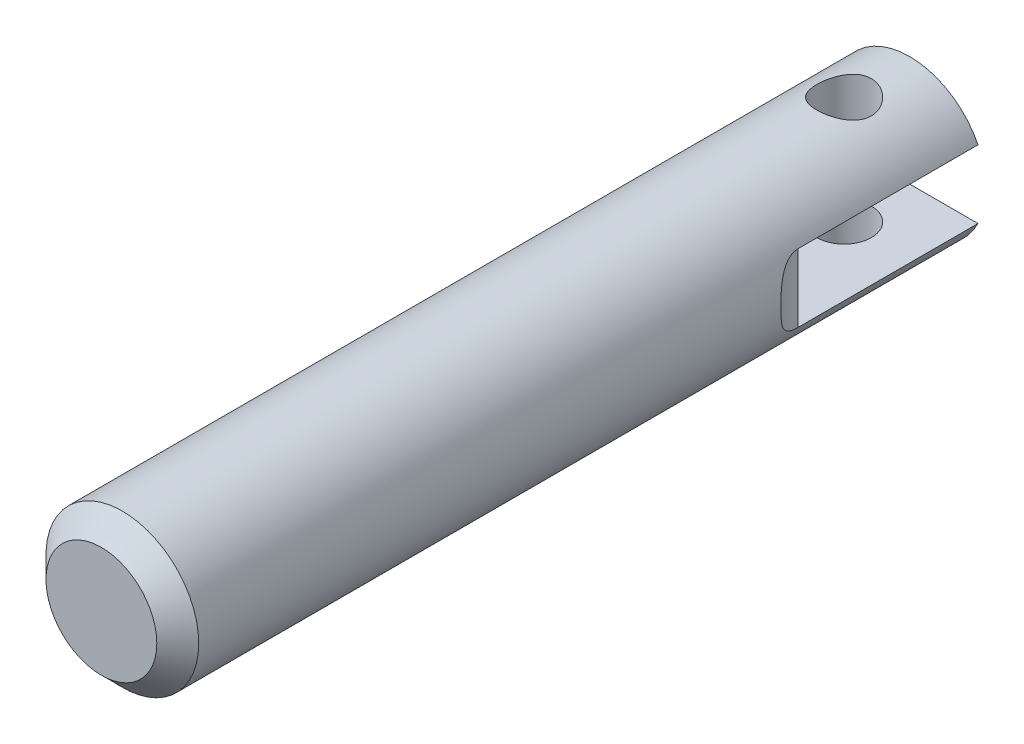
ISO-10303-21;
HEADER;
FILE_DESCRIPTION(('STEP AP214'),'2;1');
FILE_NAME('part.step','',(''),(''),'','','');
FILE_SCHEMA(('AUTOMOTIVE_DESIGN { 1 0 10303 214 1 1 1 1 }'));
ENDSEC;
DATA;
#1=APPLICATION_CONTEXT('core data for automotive mechanical design processes');
#2=APPLICATION_PROTOCOL_DEFINITION('international standard','automotive_design',2000,#1);
#3=PRODUCT_CONTEXT('',#1,'mechanical');
#4=PRODUCT('Part','Part','',(#3));
#5=PRODUCT_RELATED_PRODUCT_CATEGORY('part','',(#4));
#6=PRODUCT_DEFINITION_FORMATION('','',#4);
#7=PRODUCT_DEFINITION_CONTEXT('part definition',#1,'design');
#8=PRODUCT_DEFINITION('design','',#6,#7);
#9=PRODUCT_DEFINITION_SHAPE('','',#8);
#10=(LENGTH_UNIT() NAMED_UNIT(*) SI_UNIT(.MILLI.,.METRE.));
#11=(NAMED_UNIT(*) PLANE_ANGLE_UNIT() SI_UNIT($,.RADIAN.));
#12=(NAMED_UNIT(*) SI_UNIT($,.STERADIAN.) SOLID_ANGLE_UNIT());
#13=UNCERTAINTY_MEASURE_WITH_UNIT(LENGTH_MEASURE(1.E-05),#10,'distance_accuracy_value','');
#14=(GEOMETRIC_REPRESENTATION_CONTEXT(3) GLOBAL_UNCERTAINTY_ASSIGNED_CONTEXT((#13)) GLOBAL_UNIT_ASSIGNED_CONTEXT((#10,
#11,#12)) REPRESENTATION_CONTEXT('',''));
#15=CARTESIAN_POINT('',(0.,0.,0.));
#16=DIRECTION('',(0.,0.,1.));
#17=DIRECTION('',(1.,0.,0.));
#18=AXIS2_PLACEMENT_3D('',#15,#16,#17);
#19=CARTESIAN_POINT('',(0.,0.,-58.7375));
#20=DIRECTION('',(0.,0.,1.));
#21=DIRECTION('',(1.,0.,0.));
#22=AXIS2_PLACEMENT_3D('',#19,#20,#21);
#23=CYLINDRICAL_SURFACE('',#22,5.5499);
#24=CARTESIAN_POINT('',(0.,-5.5499,-51.9938));
#25=CARTESIAN_POINT('',(-0.107653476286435,-5.54990159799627,-51.9937977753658));
#26=CARTESIAN_POINT('',(-0.215291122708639,-5.54673970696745,-52.0026024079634));
#27=CARTESIAN_POINT('',(-0.427369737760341,-5.53444015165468,-52.0374614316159));
#28=CARTESIAN_POINT('',(-0.53181082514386,-5.52530270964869,-52.0635151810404));
#29=CARTESIAN_POINT('',(-0.73440812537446,-5.50203829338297,-52.1318472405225));
#30=CARTESIAN_POINT('',(-0.832575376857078,-5.48792038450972,-52.1740960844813));
#31=CARTESIAN_POINT('',(-1.02042663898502,-5.45611651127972,-52.273476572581));
#32=CARTESIAN_POINT('',(-1.11010861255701,-5.43842969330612,-52.3306117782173));
#33=CARTESIAN_POINT('',(-1.28194408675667,-5.40055797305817,-52.4604783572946));
#34=CARTESIAN_POINT('',(-1.36372163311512,-5.38030706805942,-52.5336877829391));
#35=CARTESIAN_POINT('',(-1.51413461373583,-5.33993096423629,-52.6926093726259));
#36=CARTESIAN_POINT('',(-1.5827665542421,-5.31980580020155,-52.7783248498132));
#37=CARTESIAN_POINT('',(-1.70722010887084,-5.28121081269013,-52.9633692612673));
#38=CARTESIAN_POINT('',(-1.76252965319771,-5.26282004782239,-53.0630607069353));
#39=CARTESIAN_POINT('',(-1.85543270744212,-5.23079269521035,-53.2710921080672));
#40=CARTESIAN_POINT('',(-1.89303254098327,-5.21715441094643,-53.3794289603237));
#41=CARTESIAN_POINT('',(-1.94799722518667,-5.19687703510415,-53.5973685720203));
#42=CARTESIAN_POINT('',(-1.96607415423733,-5.18999254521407,-53.7067681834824));
#43=CARTESIAN_POINT('',(-1.9837065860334,-5.18328042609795,-53.9272478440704));
#44=CARTESIAN_POINT('',(-1.98326884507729,-5.18345022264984,-54.0383272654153));
#45=CARTESIAN_POINT('',(-1.96443253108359,-5.19061434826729,-54.2527026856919));
#46=CARTESIAN_POINT('',(-1.94699465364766,-5.19724363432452,-54.3560974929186));
#47=CARTESIAN_POINT('',(-1.89623189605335,-5.21597727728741,-54.5583834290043));
#48=CARTESIAN_POINT('',(-1.86290484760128,-5.22808238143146,-54.6572739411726));
#49=CARTESIAN_POINT('',(-1.78073810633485,-5.25664108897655,-54.8498013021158));
#50=CARTESIAN_POINT('',(-1.73163368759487,-5.27316803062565,-54.9433138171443));
#51=CARTESIAN_POINT('',(-1.61949015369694,-5.30868100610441,-55.1210614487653));
#52=CARTESIAN_POINT('',(-1.55644656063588,-5.32766782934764,-55.2052935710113));
#53=CARTESIAN_POINT('',(-1.41372164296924,-5.36736271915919,-55.3674443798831));
#54=CARTESIAN_POINT('',(-1.33326496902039,-5.38810545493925,-55.4446736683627));
#55=CARTESIAN_POINT('',(-1.16029481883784,-5.42798069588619,-55.5847375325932));
#56=CARTESIAN_POINT('',(-1.06777982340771,-5.44711299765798,-55.6475702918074));
#57=CARTESIAN_POINT('',(-0.871693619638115,-5.48193106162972,-55.7577239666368));
#58=CARTESIAN_POINT('',(-0.767995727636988,-5.49756942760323,-55.8048354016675));
#59=CARTESIAN_POINT('',(-0.553451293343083,-5.52328978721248,-55.8807223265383));
#60=CARTESIAN_POINT('',(-0.442607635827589,-5.53337400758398,-55.9095051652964));
#61=CARTESIAN_POINT('',(-0.222735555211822,-5.54646843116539,-55.9466391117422));
#62=CARTESIAN_POINT('',(-0.113883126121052,-5.5498002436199,-55.9559199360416));
#63=CARTESIAN_POINT('',(0.103860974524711,-5.5499952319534,-55.9564673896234));
#64=CARTESIAN_POINT('',(0.212752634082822,-5.54685968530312,-55.9477375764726));
#65=CARTESIAN_POINT('',(0.423599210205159,-5.53468482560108,-55.9132320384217));
#66=CARTESIAN_POINT('',(0.525664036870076,-5.52585063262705,-55.8880481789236));
#67=CARTESIAN_POINT('',(0.724062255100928,-5.50337165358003,-55.8221111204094));
#68=CARTESIAN_POINT('',(0.82039490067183,-5.489726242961,-55.7813559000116));
#69=CARTESIAN_POINT('',(1.00763066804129,-5.45851059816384,-55.6841732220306));
#70=CARTESIAN_POINT('',(1.09830410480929,-5.44084054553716,-55.6273362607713));
#71=CARTESIAN_POINT('',(1.26911613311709,-5.40355346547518,-55.5000738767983));
#72=CARTESIAN_POINT('',(1.3492510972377,-5.38393577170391,-55.42964379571));
#73=CARTESIAN_POINT('',(1.50109735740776,-5.34364971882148,-55.2728383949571));
#74=CARTESIAN_POINT('',(1.57214657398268,-5.32298020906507,-55.1858205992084));
#75=CARTESIAN_POINT('',(1.69874319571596,-5.28394395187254,-55.0006708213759));
#76=CARTESIAN_POINT('',(1.75428984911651,-5.26557731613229,-54.9025383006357));
#77=CARTESIAN_POINT('',(1.84820044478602,-5.23335709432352,-54.6975154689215));
#78=CARTESIAN_POINT('',(1.88654644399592,-5.21950822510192,-54.5906161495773));
#79=CARTESIAN_POINT('',(1.94447571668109,-5.19820885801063,-54.3712548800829));
#80=CARTESIAN_POINT('',(1.9640691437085,-5.19075489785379,-54.2587959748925));
#81=CARTESIAN_POINT('',(1.98307797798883,-5.18352052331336,-54.0386047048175));
#82=CARTESIAN_POINT('',(1.98360873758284,-5.1833159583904,-53.9309816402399));
#83=CARTESIAN_POINT('',(1.96728484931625,-5.18953321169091,-53.7172674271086));
#84=CARTESIAN_POINT('',(1.95043155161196,-5.19595451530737,-53.6111761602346));
#85=CARTESIAN_POINT('',(1.90065338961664,-5.21436277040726,-53.406211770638));
#86=CARTESIAN_POINT('',(1.86814141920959,-5.22620636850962,-53.3072244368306));
#87=CARTESIAN_POINT('',(1.78831843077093,-5.25405419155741,-53.1160420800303));
#88=CARTESIAN_POINT('',(1.74100385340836,-5.27005941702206,-53.0238486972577));
#89=CARTESIAN_POINT('',(1.63023820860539,-5.30539772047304,-52.8439971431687));
#90=CARTESIAN_POINT('',(1.56611356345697,-5.32485489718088,-52.7567784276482));
#91=CARTESIAN_POINT('',(1.42463268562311,-5.3644386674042,-52.5939811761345));
#92=CARTESIAN_POINT('',(1.3472724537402,-5.38456546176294,-52.5184061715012));
#93=CARTESIAN_POINT('',(1.1771480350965,-5.42436029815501,-52.3774261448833));
#94=CARTESIAN_POINT('',(1.08382958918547,-5.44396198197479,-52.312668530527));
#95=CARTESIAN_POINT('',(0.886959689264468,-5.47947839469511,-52.1998027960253));
#96=CARTESIAN_POINT('',(0.783409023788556,-5.49539340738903,-52.1516933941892));
#97=CARTESIAN_POINT('',(0.568515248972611,-5.52176869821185,-52.0736704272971));
#98=CARTESIAN_POINT('',(0.457143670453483,-5.53220773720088,-52.043827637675));
#99=CARTESIAN_POINT('',(0.230507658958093,-5.54627120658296,-52.0038974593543));
#100=CARTESIAN_POINT('',(0.115244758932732,-5.54989828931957,-51.9938023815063));
#101=CARTESIAN_POINT('',(0.,-5.5499,-51.9938));
#102=B_SPLINE_CURVE_WITH_KNOTS('',3,(#24,#25,#26,#27,#28,#29,#30,#31,#32,#33,#34,#35,#36,#37,
#38,#39,#40,#41,#42,#43,#44,#45,#46,#47,#48,#49,#50,#51,#52,#53,#54,#55,#56,#57,#58,#59,#60,#61,
#62,#63,#64,#65,#66,#67,#68,#69,#70,#71,#72,#73,#74,#75,#76,#77,#78,#79,#80,#81,#82,#83,#84,#85,
#86,#87,#88,#89,#90,#91,#92,#93,#94,#95,#96,#97,#98,#99,#100,#101),.UNSPECIFIED.,.T.,.F.,(4,2,2,
2,2,2,2,2,2,2,2,2,2,2,2,2,2,2,2,2,2,2,2,2,2,2,2,2,2,2,2,2,2,2,2,2,2,2,4),(0.,0.32253577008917,
0.645059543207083,0.966999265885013,1.28901608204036,1.62236399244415,1.95580037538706,
2.30051976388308,2.64511596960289,2.9766682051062,3.30809945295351,3.62182603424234,
3.93559544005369,4.25493155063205,4.57437039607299,4.91311834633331,5.25190901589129,
5.59504875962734,5.93805083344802,6.26429118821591,6.59046710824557,6.90551213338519,
7.22059806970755,7.544568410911,7.86864997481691,8.20972589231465,8.55081834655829,
8.89226579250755,9.23352825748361,9.55478885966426,9.87602451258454,10.1892184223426,
10.5024876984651,10.8310117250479,11.1596351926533,11.5037509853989,11.847840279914,
12.1932544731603,12.5385341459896),.UNSPECIFIED.);
#103=CARTESIAN_POINT('',(0.,-5.5499,-51.9938));
#104=VERTEX_POINT('',#103);
#105=EDGE_CURVE('E84',#104,#104,#102,.T.);
#106=ORIENTED_EDGE('',*,*,#105,.F.);
#107=EDGE_LOOP('',(#106));
#108=FACE_BOUND('',#107,.T.);
#109=CARTESIAN_POINT('',(0.,5.5499,-51.9938));
#110=CARTESIAN_POINT('',(0.107653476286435,5.54990159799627,-51.9937977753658));
#111=CARTESIAN_POINT('',(0.215291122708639,5.54673970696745,-52.0026024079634));
#112=CARTESIAN_POINT('',(0.427369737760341,5.53444015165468,-52.0374614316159));
#113=CARTESIAN_POINT('',(0.53181082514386,5.52530270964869,-52.0635151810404));
#114=CARTESIAN_POINT('',(0.73440812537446,5.50203829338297,-52.1318472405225));
#115=CARTESIAN_POINT('',(0.832575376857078,5.48792038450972,-52.1740960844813));
#116=CARTESIAN_POINT('',(1.02042663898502,5.45611651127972,-52.273476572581));
#117=CARTESIAN_POINT('',(1.11010861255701,5.43842969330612,-52.3306117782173));
#118=CARTESIAN_POINT('',(1.28194408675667,5.40055797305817,-52.4604783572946));
#119=CARTESIAN_POINT('',(1.36372163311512,5.38030706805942,-52.5336877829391));
#120=CARTESIAN_POINT('',(1.51413461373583,5.33993096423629,-52.6926093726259));
#121=CARTESIAN_POINT('',(1.5827665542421,5.31980580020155,-52.7783248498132));
#122=CARTESIAN_POINT('',(1.70722010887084,5.28121081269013,-52.9633692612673));
#123=CARTESIAN_POINT('',(1.76252965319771,5.26282004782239,-53.0630607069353));
#124=CARTESIAN_POINT('',(1.85543270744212,5.23079269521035,-53.2710921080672));
#125=CARTESIAN_POINT('',(1.89303254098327,5.21715441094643,-53.3794289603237));
#126=CARTESIAN_POINT('',(1.94799722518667,5.19687703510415,-53.5973685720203));
#127=CARTESIAN_POINT('',(1.96607415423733,5.18999254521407,-53.7067681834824));
#128=CARTESIAN_POINT('',(1.9837065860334,5.18328042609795,-53.9272478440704));
#129=CARTESIAN_POINT('',(1.98326884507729,5.18345022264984,-54.0383272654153));
#130=CARTESIAN_POINT('',(1.96443253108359,5.19061434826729,-54.2527026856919));
#131=CARTESIAN_POINT('',(1.94699465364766,5.19724363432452,-54.3560974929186));
#132=CARTESIAN_POINT('',(1.89623189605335,5.21597727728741,-54.5583834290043));
#133=CARTESIAN_POINT('',(1.86290484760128,5.22808238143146,-54.6572739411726));
#134=CARTESIAN_POINT('',(1.78073810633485,5.25664108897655,-54.8498013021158));
#135=CARTESIAN_POINT('',(1.73163368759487,5.27316803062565,-54.9433138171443));
#136=CARTESIAN_POINT('',(1.61949015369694,5.30868100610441,-55.1210614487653));
#137=CARTESIAN_POINT('',(1.55644656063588,5.32766782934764,-55.2052935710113));
#138=CARTESIAN_POINT('',(1.41372164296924,5.36736271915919,-55.3674443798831));
#139=CARTESIAN_POINT('',(1.33326496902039,5.38810545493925,-55.4446736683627));
#140=CARTESIAN_POINT('',(1.16029481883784,5.42798069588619,-55.5847375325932));
#141=CARTESIAN_POINT('',(1.06777982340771,5.44711299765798,-55.6475702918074));
#142=CARTESIAN_POINT('',(0.871693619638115,5.48193106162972,-55.7577239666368));
#143=CARTESIAN_POINT('',(0.767995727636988,5.49756942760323,-55.8048354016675));
#144=CARTESIAN_POINT('',(0.553451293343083,5.52328978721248,-55.8807223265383));
#145=CARTESIAN_POINT('',(0.442607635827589,5.53337400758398,-55.9095051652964));
#146=CARTESIAN_POINT('',(0.222735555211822,5.54646843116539,-55.9466391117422));
#147=CARTESIAN_POINT('',(0.113883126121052,5.5498002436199,-55.9559199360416));
#148=CARTESIAN_POINT('',(-0.103860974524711,5.5499952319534,-55.9564673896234));
#149=CARTESIAN_POINT('',(-0.212752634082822,5.54685968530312,-55.9477375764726));
#150=CARTESIAN_POINT('',(-0.423599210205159,5.53468482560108,-55.9132320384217));
#151=CARTESIAN_POINT('',(-0.525664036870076,5.52585063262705,-55.8880481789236));
#152=CARTESIAN_POINT('',(-0.724062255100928,5.50337165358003,-55.8221111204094));
#153=CARTESIAN_POINT('',(-0.82039490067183,5.489726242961,-55.7813559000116));
#154=CARTESIAN_POINT('',(-1.00763066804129,5.45851059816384,-55.6841732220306));
#155=CARTESIAN_POINT('',(-1.09830410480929,5.44084054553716,-55.6273362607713));
#156=CARTESIAN_POINT('',(-1.26911613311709,5.40355346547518,-55.5000738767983));
#157=CARTESIAN_POINT('',(-1.3492510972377,5.38393577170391,-55.42964379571));
#158=CARTESIAN_POINT('',(-1.50109735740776,5.34364971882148,-55.2728383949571));
#159=CARTESIAN_POINT('',(-1.57214657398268,5.32298020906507,-55.1858205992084));
#160=CARTESIAN_POINT('',(-1.69874319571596,5.28394395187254,-55.0006708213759));
#161=CARTESIAN_POINT('',(-1.75428984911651,5.26557731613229,-54.9025383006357));
#162=CARTESIAN_POINT('',(-1.84820044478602,5.23335709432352,-54.6975154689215));
#163=CARTESIAN_POINT('',(-1.88654644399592,5.21950822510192,-54.5906161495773));
#164=CARTESIAN_POINT('',(-1.94447571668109,5.19820885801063,-54.3712548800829));
#165=CARTESIAN_POINT('',(-1.9640691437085,5.19075489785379,-54.2587959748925));
#166=CARTESIAN_POINT('',(-1.98307797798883,5.18352052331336,-54.0386047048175));
#167=CARTESIAN_POINT('',(-1.98360873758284,5.1833159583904,-53.9309816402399));
#168=CARTESIAN_POINT('',(-1.96728484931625,5.18953321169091,-53.7172674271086));
#169=CARTESIAN_POINT('',(-1.95043155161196,5.19595451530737,-53.6111761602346));
#170=CARTESIAN_POINT('',(-1.90065338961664,5.21436277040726,-53.406211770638));
#171=CARTESIAN_POINT('',(-1.86814141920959,5.22620636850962,-53.3072244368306));
#172=CARTESIAN_POINT('',(-1.78831843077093,5.25405419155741,-53.1160420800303));
#173=CARTESIAN_POINT('',(-1.74100385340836,5.27005941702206,-53.0238486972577));
#174=CARTESIAN_POINT('',(-1.63023820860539,5.30539772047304,-52.8439971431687));
#175=CARTESIAN_POINT('',(-1.56611356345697,5.32485489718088,-52.7567784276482));
#176=CARTESIAN_POINT('',(-1.42463268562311,5.3644386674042,-52.5939811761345));
#177=CARTESIAN_POINT('',(-1.3472724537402,5.38456546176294,-52.5184061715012));
#178=CARTESIAN_POINT('',(-1.1771480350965,5.42436029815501,-52.3774261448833));
#179=CARTESIAN_POINT('',(-1.08382958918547,5.44396198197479,-52.312668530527));
#180=CARTESIAN_POINT('',(-0.886959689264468,5.47947839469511,-52.1998027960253));
#181=CARTESIAN_POINT('',(-0.783409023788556,5.49539340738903,-52.1516933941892));
#182=CARTESIAN_POINT('',(-0.568515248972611,5.52176869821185,-52.0736704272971));
#183=CARTESIAN_POINT('',(-0.457143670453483,5.53220773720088,-52.043827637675));
#184=CARTESIAN_POINT('',(-0.230507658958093,5.54627120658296,-52.0038974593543));
#185=CARTESIAN_POINT('',(-0.115244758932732,5.54989828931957,-51.9938023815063));
#186=CARTESIAN_POINT('',(0.,5.5499,-51.9938));
#187=B_SPLINE_CURVE_WITH_KNOTS('',3,(#109,#110,#111,#112,#113,#114,#115,#116,#117,#118,#119,
#120,#121,#122,#123,#124,#125,#126,#127,#128,#129,#130,#131,#132,#133,#134,#135,#136,#137,#138,
#139,#140,#141,#142,#143,#144,#145,#146,#147,#148,#149,#150,#151,#152,#153,#154,#155,#156,#157,
#158,#159,#160,#161,#162,#163,#164,#165,#166,#167,#168,#169,#170,#171,#172,#173,#174,#175,#176,
#177,#178,#179,#180,#181,#182,#183,#184,#185,#186),.UNSPECIFIED.,.T.,.F.,(4,2,2,2,2,2,2,2,2,2,2,
2,2,2,2,2,2,2,2,2,2,2,2,2,2,2,2,2,2,2,2,2,2,2,2,2,2,2,4),(0.,0.32253577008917,0.645059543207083,
0.966999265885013,1.28901608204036,1.62236399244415,1.95580037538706,2.30051976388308,
2.64511596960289,2.9766682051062,3.30809945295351,3.62182603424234,3.93559544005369,
4.25493155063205,4.57437039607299,4.91311834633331,5.25190901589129,5.59504875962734,
5.93805083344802,6.26429118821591,6.59046710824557,6.90551213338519,7.22059806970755,
7.544568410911,7.86864997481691,8.20972589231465,8.55081834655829,8.89226579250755,
9.23352825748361,9.55478885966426,9.87602451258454,10.1892184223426,10.5024876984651,
10.8310117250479,11.1596351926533,11.5037509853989,11.847840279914,12.1932544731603,
12.5385341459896),.UNSPECIFIED.);
#188=CARTESIAN_POINT('',(0.,5.5499,-51.9938));
#189=VERTEX_POINT('',#188);
#190=EDGE_CURVE('E157',#189,#189,#187,.T.);
#191=ORIENTED_EDGE('',*,*,#190,.F.);
#192=EDGE_LOOP('',(#191));
#193=FACE_BOUND('',#192,.T.);
#194=CARTESIAN_POINT('',(0.,0.,-1.52400000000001));
#195=DIRECTION('',(0.,0.,1.));
#196=DIRECTION('',(1.,0.,0.));
#197=AXIS2_PLACEMENT_3D('',#194,#195,#196);
#198=CIRCLE('',#197,5.5499);
#199=CARTESIAN_POINT('',(5.5499,0.,-1.52400000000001));
#200=VERTEX_POINT('',#199);
#201=EDGE_CURVE('E123',#200,#200,#198,.F.);
#202=ORIENTED_EDGE('',*,*,#201,.T.);
#203=EDGE_LOOP('',(#202));
#204=FACE_BOUND('',#203,.T.);
#205=DIRECTION('',(0.,0.,1.));
#206=VECTOR('',#205,1.);
#207=CARTESIAN_POINT('',(-4.96672304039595,2.4765,-58.7375));
#208=LINE('',#207,#206);
#209=CARTESIAN_POINT('',(-4.96672304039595,2.4765,-58.7375));
#210=VERTEX_POINT('',#209);
#211=CARTESIAN_POINT('',(-4.96672304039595,2.4765,-45.6565));
#212=VERTEX_POINT('',#211);
#213=EDGE_CURVE('E51',#210,#212,#208,.T.);
#214=ORIENTED_EDGE('',*,*,#213,.T.);
#215=CARTESIAN_POINT('',(-5.5499,0.,-47.4903697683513));
#216=CARTESIAN_POINT('',(-5.54989925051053,0.0810977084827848,-47.4903702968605));
#217=CARTESIAN_POINT('',(-5.548119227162,0.162213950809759,-47.4878611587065));
#218=CARTESIAN_POINT('',(-5.5410275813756,0.323978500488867,-47.4777755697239));
#219=CARTESIAN_POINT('',(-5.53571549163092,0.404626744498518,-47.4701984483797));
#220=CARTESIAN_POINT('',(-5.5216307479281,0.565246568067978,-47.449792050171));
#221=CARTESIAN_POINT('',(-5.51284607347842,0.645214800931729,-47.4369445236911));
#222=CARTESIAN_POINT('',(-5.49199361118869,0.803599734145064,-47.4057600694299));
#223=CARTESIAN_POINT('',(-5.47992758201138,0.882017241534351,-47.3874260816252));
#224=CARTESIAN_POINT('',(-5.45266509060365,1.03735188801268,-47.3447650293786));
#225=CARTESIAN_POINT('',(-5.43744442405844,1.11425206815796,-47.3203913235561));
#226=CARTESIAN_POINT('',(-5.40431869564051,1.26518746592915,-47.2653119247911));
#227=CARTESIAN_POINT('',(-5.38641305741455,1.33922206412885,-47.2346048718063));
#228=CARTESIAN_POINT('',(-5.34852203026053,1.48331735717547,-47.1665217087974));
#229=CARTESIAN_POINT('',(-5.32854359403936,1.55339019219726,-47.1291676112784));
#230=CARTESIAN_POINT('',(-5.2872019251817,1.68875525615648,-47.0473390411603));
#231=CARTESIAN_POINT('',(-5.26583969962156,1.75405088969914,-47.0028697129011));
#232=CARTESIAN_POINT('',(-5.21757201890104,1.89339622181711,-46.8951360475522));
#233=CARTESIAN_POINT('',(-5.19054029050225,1.96591350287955,-46.8299091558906));
#234=CARTESIAN_POINT('',(-5.1379956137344,2.09941626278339,-46.6879819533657));
#235=CARTESIAN_POINT('',(-5.11248199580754,2.1604068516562,-46.6112867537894));
#236=CARTESIAN_POINT('',(-5.06537701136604,2.26867280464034,-46.4465074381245));
#237=CARTESIAN_POINT('',(-5.04382291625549,2.3158201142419,-46.3583272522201));
#238=CARTESIAN_POINT('',(-5.00767787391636,2.39298990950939,-46.1734253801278));
#239=CARTESIAN_POINT('',(-4.99308022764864,2.42302887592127,-46.0767120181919));
#240=CARTESIAN_POINT('',(-4.97435221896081,2.46121747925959,-45.8925391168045));
#241=CARTESIAN_POINT('',(-4.96903016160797,2.47186903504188,-45.8057147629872));
#242=CARTESIAN_POINT('',(-4.96562843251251,2.47869847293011,-45.6313717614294));
#243=CARTESIAN_POINT('',(-4.96754514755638,2.47488357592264,-45.5438534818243));
#244=CARTESIAN_POINT('',(-4.9779417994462,2.4538944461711,-45.3782225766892));
#245=CARTESIAN_POINT('',(-4.98586918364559,2.43784434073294,-45.2999282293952));
#246=CARTESIAN_POINT('',(-5.00687394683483,2.39440614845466,-45.1473025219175));
#247=CARTESIAN_POINT('',(-5.01995130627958,2.36701810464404,-45.0729711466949));
#248=CARTESIAN_POINT('',(-5.05066737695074,2.30076513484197,-44.9272900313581));
#249=CARTESIAN_POINT('',(-5.06845391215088,2.2615210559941,-44.8561452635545));
#250=CARTESIAN_POINT('',(-5.10686211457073,2.17339763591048,-44.7209839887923));
#251=CARTESIAN_POINT('',(-5.12748471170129,2.12451513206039,-44.6569698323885));
#252=CARTESIAN_POINT('',(-5.17292348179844,2.01157050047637,-44.528630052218));
#253=CARTESIAN_POINT('',(-5.19793284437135,1.94635456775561,-44.4653922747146));
#254=CARTESIAN_POINT('',(-5.24781749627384,1.80755804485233,-44.3488463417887));
#255=CARTESIAN_POINT('',(-5.27269265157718,1.73397029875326,-44.2955467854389));
#256=CARTESIAN_POINT('',(-5.33327791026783,1.5402678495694,-44.1732316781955));
#257=CARTESIAN_POINT('',(-5.36789747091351,1.41585420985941,-44.1104519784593));
#258=CARTESIAN_POINT('',(-5.42956670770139,1.15714553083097,-44.0046576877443));
#259=CARTESIAN_POINT('',(-5.45660346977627,1.02283412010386,-43.9616767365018));
#260=CARTESIAN_POINT('',(-5.50136495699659,0.745920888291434,-43.8927414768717));
#261=CARTESIAN_POINT('',(-5.51891784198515,0.603214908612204,-43.867099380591));
#262=CARTESIAN_POINT('',(-5.5428502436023,0.314852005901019,-43.8325117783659));
#263=CARTESIAN_POINT('',(-5.54922756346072,0.169194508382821,-43.8235695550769));
#264=CARTESIAN_POINT('',(-5.55022339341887,-0.0638077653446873,-43.8221797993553));
#265=CARTESIAN_POINT('',(-5.54852684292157,-0.151156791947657,-43.8245626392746));
#266=CARTESIAN_POINT('',(-5.54104195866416,-0.325313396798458,-43.8352006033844));
#267=CARTESIAN_POINT('',(-5.53525473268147,-0.412121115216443,-43.8434541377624));
#268=CARTESIAN_POINT('',(-5.51970247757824,-0.584614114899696,-43.8660192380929));
#269=CARTESIAN_POINT('',(-5.50993646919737,-0.670299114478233,-43.880332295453));
#270=CARTESIAN_POINT('',(-5.48666013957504,-0.839807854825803,-43.915321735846));
#271=CARTESIAN_POINT('',(-5.47315090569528,-0.923632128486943,-43.935996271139));
#272=CARTESIAN_POINT('',(-5.43416410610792,-1.13505983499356,-43.9976547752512));
#273=CARTESIAN_POINT('',(-5.40622363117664,-1.26084707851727,-44.0435259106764));
#274=CARTESIAN_POINT('',(-5.34414720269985,-1.50231906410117,-44.1537753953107));
#275=CARTESIAN_POINT('',(-5.31002163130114,-1.61802026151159,-44.2181228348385));
#276=CARTESIAN_POINT('',(-5.24706326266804,-1.81041123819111,-44.3504937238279));
#277=CARTESIAN_POINT('',(-5.21875292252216,-1.89003958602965,-44.4144788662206));
#278=CARTESIAN_POINT('',(-5.16292620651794,-2.03759310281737,-44.5550948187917));
#279=CARTESIAN_POINT('',(-5.13540895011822,-2.1055317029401,-44.6317109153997));
#280=CARTESIAN_POINT('',(-5.08821779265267,-2.21686581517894,-44.7835831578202));
#281=CARTESIAN_POINT('',(-5.06799509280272,-2.26245351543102,-44.8570563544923));
#282=CARTESIAN_POINT('',(-5.03196429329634,-2.34149918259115,-45.0113010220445));
#283=CARTESIAN_POINT('',(-5.01615462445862,-2.37496146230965,-45.0920698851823));
#284=CARTESIAN_POINT('',(-4.99051828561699,-2.42837669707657,-45.2593591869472));
#285=CARTESIAN_POINT('',(-4.9807219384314,-2.44826124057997,-45.3459063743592));
#286=CARTESIAN_POINT('',(-4.9683691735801,-2.47323711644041,-45.5216195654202));
#287=CARTESIAN_POINT('',(-4.96581031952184,-2.47833342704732,-45.6107846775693));
#288=CARTESIAN_POINT('',(-4.96811476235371,-2.47370601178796,-45.7805967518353));
#289=CARTESIAN_POINT('',(-4.97233379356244,-2.4652688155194,-45.8612913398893));
#290=CARTESIAN_POINT('',(-4.98658637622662,-2.43630941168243,-46.0199269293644));
#291=CARTESIAN_POINT('',(-4.99661926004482,-2.41578859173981,-46.0978682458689));
#292=CARTESIAN_POINT('',(-5.0215872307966,-2.3634476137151,-46.2491883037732));
#293=CARTESIAN_POINT('',(-5.03653329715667,-2.33160213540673,-46.3225563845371));
#294=CARTESIAN_POINT('',(-5.07003769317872,-2.25781861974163,-46.4630990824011));
#295=CARTESIAN_POINT('',(-5.08859698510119,-2.21587789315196,-46.5302720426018));
#296=CARTESIAN_POINT('',(-5.12997813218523,-2.11843951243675,-46.6641873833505));
#297=CARTESIAN_POINT('',(-5.15304265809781,-2.06198433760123,-46.7301547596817));
#298=CARTESIAN_POINT('',(-5.20007695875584,-1.94032427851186,-46.8530276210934));
#299=CARTESIAN_POINT('',(-5.22404724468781,-1.87511439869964,-46.9099278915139));
#300=CARTESIAN_POINT('',(-5.28288037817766,-1.70416449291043,-47.0403318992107));
#301=CARTESIAN_POINT('',(-5.31736222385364,-1.59415328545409,-47.1084244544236));
#302=CARTESIAN_POINT('',(-5.38120813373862,-1.36323621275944,-47.2264397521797));
#303=CARTESIAN_POINT('',(-5.41055777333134,-1.24230104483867,-47.2763116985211));
#304=CARTESIAN_POINT('',(-5.45228553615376,-1.03943978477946,-47.3442432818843));
#305=CARTESIAN_POINT('',(-5.46693129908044,-0.959570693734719,-47.367252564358));
#306=CARTESIAN_POINT('',(-5.49287689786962,-0.797746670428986,-47.4071603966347));
#307=CARTESIAN_POINT('',(-5.50417543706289,-0.715790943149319,-47.4240565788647));
#308=CARTESIAN_POINT('',(-5.52313766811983,-0.550670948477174,-47.4520272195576));
#309=CARTESIAN_POINT('',(-5.53080890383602,-0.467509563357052,-47.4631137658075));
#310=CARTESIAN_POINT('',(-5.54239519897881,-0.300416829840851,-47.4797455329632));
#311=CARTESIAN_POINT('',(-5.54631249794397,-0.21648597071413,-47.4852940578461));
#312=CARTESIAN_POINT('',(-5.5493732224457,-0.0883161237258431,-47.4896250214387));
#313=CARTESIAN_POINT('',(-5.54990040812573,-0.0441608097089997,-47.4903694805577));
#314=CARTESIAN_POINT('',(-5.5499,0.,-47.4903697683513));
#315=B_SPLINE_CURVE_WITH_KNOTS('',3,(#215,#216,#217,#218,#219,#220,#221,#222,#223,#224,#225,
#226,#227,#228,#229,#230,#231,#232,#233,#234,#235,#236,#237,#238,#239,#240,#241,#242,#243,#244,
#245,#246,#247,#248,#249,#250,#251,#252,#253,#254,#255,#256,#257,#258,#259,#260,#261,#262,#263,
#264,#265,#266,#267,#268,#269,#270,#271,#272,#273,#274,#275,#276,#277,#278,#279,#280,#281,#282,
#283,#284,#285,#286,#287,#288,#289,#290,#291,#292,#293,#294,#295,#296,#297,#298,#299,#300,#301,
#302,#303,#304,#305,#306,#307,#308,#309,#310,#311,#312,#313,#314),.UNSPECIFIED.,.T.,.F.,(4,2,2,
2,2,2,2,2,2,2,2,2,2,2,2,2,2,2,2,2,2,2,2,2,2,2,2,2,2,2,2,2,2,2,2,2,2,2,2,2,2,2,2,2,2,2,2,2,2,4),
(0.,0.243266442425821,0.486565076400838,0.730713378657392,0.974731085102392,1.22069537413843,
1.46671253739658,1.71192965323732,1.95697027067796,2.2594126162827,2.56172056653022,
2.86674270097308,3.17147050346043,3.43294201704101,3.69428303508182,3.93413783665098,
4.17399172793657,4.42251772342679,4.67112540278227,4.95275213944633,5.23462143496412,
5.66303414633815,6.0921721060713,6.52884505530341,6.96560383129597,7.22754184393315,
7.48940894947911,7.75134054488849,8.01319613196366,8.42192685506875,8.82997774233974,
9.14679882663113,9.46325342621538,9.72854298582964,9.99373809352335,10.2602597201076,
10.5266916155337,10.7692594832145,11.0117995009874,11.2548852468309,11.4980358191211,
11.7665361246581,12.0351902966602,12.4346935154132,12.8353021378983,13.0882082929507,
13.3412122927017,13.5936877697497,13.8460125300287,13.9784804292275),.UNSPECIFIED.);
#316=CARTESIAN_POINT('',(-4.96672304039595,-2.4765,-45.6565));
#317=VERTEX_POINT('',#316);
#318=EDGE_CURVE('E80',#212,#317,#315,.T.);
#319=ORIENTED_EDGE('',*,*,#318,.T.);
#320=DIRECTION('',(0.,0.,1.));
#321=VECTOR('',#320,1.);
#322=CARTESIAN_POINT('',(-4.96672304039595,-2.4765,-58.7375));
#323=LINE('',#322,#321);
#324=CARTESIAN_POINT('',(-4.96672304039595,-2.4765,-58.7375));
#325=VERTEX_POINT('',#324);
#326=EDGE_CURVE('E90',#325,#317,#323,.T.);
#327=ORIENTED_EDGE('',*,*,#326,.F.);
#328=CARTESIAN_POINT('',(0.,0.,-58.7375));
#329=DIRECTION('',(0.,0.,1.));
#330=DIRECTION('',(1.,0.,0.));
#331=AXIS2_PLACEMENT_3D('',#328,#329,#330);
#332=CIRCLE('',#331,5.5499);
#333=CARTESIAN_POINT('',(4.96672304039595,-2.4765,-58.7375));
#334=VERTEX_POINT('',#333);
#335=EDGE_CURVE('E117',#325,#334,#332,.T.);
#336=ORIENTED_EDGE('',*,*,#335,.T.);
#337=DIRECTION('',(0.,0.,1.));
#338=VECTOR('',#337,1.);
#339=CARTESIAN_POINT('',(4.96672304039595,-2.4765,-58.7375));
#340=LINE('',#339,#338);
#341=CARTESIAN_POINT('',(4.96672304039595,-2.4765,-45.6565));
#342=VERTEX_POINT('',#341);
#343=EDGE_CURVE('E100',#342,#334,#340,.F.);
#344=ORIENTED_EDGE('',*,*,#343,.F.);
#345=CARTESIAN_POINT('',(5.5499,0.,-47.4903697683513));
#346=CARTESIAN_POINT('',(5.54989925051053,0.0810977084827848,-47.4903702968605));
#347=CARTESIAN_POINT('',(5.548119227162,0.162213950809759,-47.4878611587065));
#348=CARTESIAN_POINT('',(5.5410275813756,0.323978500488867,-47.4777755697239));
#349=CARTESIAN_POINT('',(5.53571549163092,0.404626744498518,-47.4701984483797));
#350=CARTESIAN_POINT('',(5.5216307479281,0.565246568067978,-47.449792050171));
#351=CARTESIAN_POINT('',(5.51284607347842,0.645214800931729,-47.4369445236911));
#352=CARTESIAN_POINT('',(5.49199361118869,0.803599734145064,-47.4057600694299));
#353=CARTESIAN_POINT('',(5.47992758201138,0.882017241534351,-47.3874260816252));
#354=CARTESIAN_POINT('',(5.45266509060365,1.03735188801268,-47.3447650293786));
#355=CARTESIAN_POINT('',(5.43744442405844,1.11425206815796,-47.3203913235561));
#356=CARTESIAN_POINT('',(5.40431869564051,1.26518746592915,-47.2653119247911));
#357=CARTESIAN_POINT('',(5.38641305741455,1.33922206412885,-47.2346048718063));
#358=CARTESIAN_POINT('',(5.34852203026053,1.48331735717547,-47.1665217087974));
#359=CARTESIAN_POINT('',(5.32854359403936,1.55339019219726,-47.1291676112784));
#360=CARTESIAN_POINT('',(5.2872019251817,1.68875525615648,-47.0473390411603));
#361=CARTESIAN_POINT('',(5.26583969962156,1.75405088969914,-47.0028697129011));
#362=CARTESIAN_POINT('',(5.21757201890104,1.89339622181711,-46.8951360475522));
#363=CARTESIAN_POINT('',(5.19054029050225,1.96591350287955,-46.8299091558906));
#364=CARTESIAN_POINT('',(5.1379956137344,2.09941626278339,-46.6879819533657));
#365=CARTESIAN_POINT('',(5.11248199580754,2.1604068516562,-46.6112867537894));
#366=CARTESIAN_POINT('',(5.06537701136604,2.26867280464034,-46.4465074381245));
#367=CARTESIAN_POINT('',(5.04382291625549,2.3158201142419,-46.3583272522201));
#368=CARTESIAN_POINT('',(5.00767787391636,2.39298990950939,-46.1734253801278));
#369=CARTESIAN_POINT('',(4.99308022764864,2.42302887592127,-46.0767120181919));
#370=CARTESIAN_POINT('',(4.97435221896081,2.46121747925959,-45.8925391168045));
#371=CARTESIAN_POINT('',(4.96903016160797,2.47186903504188,-45.8057147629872));
#372=CARTESIAN_POINT('',(4.96562843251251,2.47869847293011,-45.6313717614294));
#373=CARTESIAN_POINT('',(4.96754514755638,2.47488357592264,-45.5438534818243));
#374=CARTESIAN_POINT('',(4.9779417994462,2.4538944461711,-45.3782225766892));
#375=CARTESIAN_POINT('',(4.98586918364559,2.43784434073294,-45.2999282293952));
#376=CARTESIAN_POINT('',(5.00687394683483,2.39440614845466,-45.1473025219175));
#377=CARTESIAN_POINT('',(5.01995130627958,2.36701810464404,-45.0729711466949));
#378=CARTESIAN_POINT('',(5.05066737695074,2.30076513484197,-44.9272900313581));
#379=CARTESIAN_POINT('',(5.06845391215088,2.2615210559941,-44.8561452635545));
#380=CARTESIAN_POINT('',(5.10686211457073,2.17339763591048,-44.7209839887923));
#381=CARTESIAN_POINT('',(5.12748471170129,2.12451513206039,-44.6569698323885));
#382=CARTESIAN_POINT('',(5.17292348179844,2.01157050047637,-44.528630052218));
#383=CARTESIAN_POINT('',(5.19793284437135,1.94635456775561,-44.4653922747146));
#384=CARTESIAN_POINT('',(5.24781749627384,1.80755804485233,-44.3488463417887));
#385=CARTESIAN_POINT('',(5.27269265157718,1.73397029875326,-44.2955467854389));
#386=CARTESIAN_POINT('',(5.33327791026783,1.5402678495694,-44.1732316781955));
#387=CARTESIAN_POINT('',(5.36789747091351,1.41585420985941,-44.1104519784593));
#388=CARTESIAN_POINT('',(5.42956670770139,1.15714553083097,-44.0046576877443));
#389=CARTESIAN_POINT('',(5.45660346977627,1.02283412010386,-43.9616767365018));
#390=CARTESIAN_POINT('',(5.50136495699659,0.745920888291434,-43.8927414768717));
#391=CARTESIAN_POINT('',(5.51891784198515,0.603214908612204,-43.867099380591));
#392=CARTESIAN_POINT('',(5.5428502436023,0.314852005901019,-43.8325117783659));
#393=CARTESIAN_POINT('',(5.54922756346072,0.169194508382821,-43.8235695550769));
#394=CARTESIAN_POINT('',(5.55022339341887,-0.0638077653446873,-43.8221797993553));
#395=CARTESIAN_POINT('',(5.54852684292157,-0.151156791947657,-43.8245626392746));
#396=CARTESIAN_POINT('',(5.54104195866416,-0.325313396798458,-43.8352006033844));
#397=CARTESIAN_POINT('',(5.53525473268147,-0.412121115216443,-43.8434541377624));
#398=CARTESIAN_POINT('',(5.51970247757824,-0.584614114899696,-43.8660192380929));
#399=CARTESIAN_POINT('',(5.50993646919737,-0.670299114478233,-43.880332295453));
#400=CARTESIAN_POINT('',(5.48666013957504,-0.839807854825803,-43.915321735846));
#401=CARTESIAN_POINT('',(5.47315090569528,-0.923632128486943,-43.935996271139));
#402=CARTESIAN_POINT('',(5.43416410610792,-1.13505983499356,-43.9976547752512));
#403=CARTESIAN_POINT('',(5.40622363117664,-1.26084707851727,-44.0435259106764));
#404=CARTESIAN_POINT('',(5.34414720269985,-1.50231906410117,-44.1537753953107));
#405=CARTESIAN_POINT('',(5.31002163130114,-1.61802026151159,-44.2181228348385));
#406=CARTESIAN_POINT('',(5.24706326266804,-1.81041123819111,-44.3504937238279));
#407=CARTESIAN_POINT('',(5.21875292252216,-1.89003958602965,-44.4144788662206));
#408=CARTESIAN_POINT('',(5.16292620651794,-2.03759310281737,-44.5550948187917));
#409=CARTESIAN_POINT('',(5.13540895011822,-2.1055317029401,-44.6317109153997));
#410=CARTESIAN_POINT('',(5.08821779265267,-2.21686581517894,-44.7835831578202));
#411=CARTESIAN_POINT('',(5.06799509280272,-2.26245351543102,-44.8570563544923));
#412=CARTESIAN_POINT('',(5.03196429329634,-2.34149918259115,-45.0113010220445));
#413=CARTESIAN_POINT('',(5.01615462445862,-2.37496146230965,-45.0920698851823));
#414=CARTESIAN_POINT('',(4.99051828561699,-2.42837669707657,-45.2593591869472));
#415=CARTESIAN_POINT('',(4.9807219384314,-2.44826124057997,-45.3459063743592));
#416=CARTESIAN_POINT('',(4.9683691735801,-2.47323711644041,-45.5216195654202));
#417=CARTESIAN_POINT('',(4.96581031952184,-2.47833342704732,-45.6107846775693));
#418=CARTESIAN_POINT('',(4.96811476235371,-2.47370601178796,-45.7805967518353));
#419=CARTESIAN_POINT('',(4.97233379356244,-2.4652688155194,-45.8612913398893));
#420=CARTESIAN_POINT('',(4.98658637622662,-2.43630941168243,-46.0199269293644));
#421=CARTESIAN_POINT('',(4.99661926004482,-2.41578859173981,-46.0978682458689));
#422=CARTESIAN_POINT('',(5.0215872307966,-2.3634476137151,-46.2491883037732));
#423=CARTESIAN_POINT('',(5.03653329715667,-2.33160213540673,-46.3225563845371));
#424=CARTESIAN_POINT('',(5.07003769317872,-2.25781861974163,-46.4630990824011));
#425=CARTESIAN_POINT('',(5.08859698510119,-2.21587789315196,-46.5302720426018));
#426=CARTESIAN_POINT('',(5.12997813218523,-2.11843951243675,-46.6641873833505));
#427=CARTESIAN_POINT('',(5.15304265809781,-2.06198433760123,-46.7301547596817));
#428=CARTESIAN_POINT('',(5.20007695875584,-1.94032427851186,-46.8530276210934));
#429=CARTESIAN_POINT('',(5.22404724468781,-1.87511439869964,-46.9099278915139));
#430=CARTESIAN_POINT('',(5.28288037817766,-1.70416449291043,-47.0403318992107));
#431=CARTESIAN_POINT('',(5.31736222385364,-1.59415328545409,-47.1084244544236));
#432=CARTESIAN_POINT('',(5.38120813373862,-1.36323621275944,-47.2264397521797));
#433=CARTESIAN_POINT('',(5.41055777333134,-1.24230104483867,-47.2763116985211));
#434=CARTESIAN_POINT('',(5.45228553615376,-1.03943978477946,-47.3442432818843));
#435=CARTESIAN_POINT('',(5.46693129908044,-0.959570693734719,-47.367252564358));
#436=CARTESIAN_POINT('',(5.49287689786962,-0.797746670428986,-47.4071603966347));
#437=CARTESIAN_POINT('',(5.50417543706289,-0.715790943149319,-47.4240565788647));
#438=CARTESIAN_POINT('',(5.52313766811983,-0.550670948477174,-47.4520272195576));
#439=CARTESIAN_POINT('',(5.53080890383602,-0.467509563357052,-47.4631137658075));
#440=CARTESIAN_POINT('',(5.54239519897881,-0.300416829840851,-47.4797455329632));
#441=CARTESIAN_POINT('',(5.54631249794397,-0.21648597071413,-47.4852940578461));
#442=CARTESIAN_POINT('',(5.5493732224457,-0.0883161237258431,-47.4896250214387));
#443=CARTESIAN_POINT('',(5.54990040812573,-0.0441608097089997,-47.4903694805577));
#444=CARTESIAN_POINT('',(5.5499,0.,-47.4903697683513));
#445=B_SPLINE_CURVE_WITH_KNOTS('',3,(#345,#346,#347,#348,#349,#350,#351,#352,#353,#354,#355,
#356,#357,#358,#359,#360,#361,#362,#363,#364,#365,#366,#367,#368,#369,#370,#371,#372,#373,#374,
#375,#376,#377,#378,#379,#380,#381,#382,#383,#384,#385,#386,#387,#388,#389,#390,#391,#392,#393,
#394,#395,#396,#397,#398,#399,#400,#401,#402,#403,#404,#405,#406,#407,#408,#409,#410,#411,#412,
#413,#414,#415,#416,#417,#418,#419,#420,#421,#422,#423,#424,#425,#426,#427,#428,#429,#430,#431,
#432,#433,#434,#435,#436,#437,#438,#439,#440,#441,#442,#443,#444),.UNSPECIFIED.,.T.,.F.,(4,2,2,
2,2,2,2,2,2,2,2,2,2,2,2,2,2,2,2,2,2,2,2,2,2,2,2,2,2,2,2,2,2,2,2,2,2,2,2,2,2,2,2,2,2,2,2,2,2,4),
(0.,0.243266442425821,0.486565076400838,0.730713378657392,0.974731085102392,1.22069537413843,
1.46671253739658,1.71192965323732,1.95697027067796,2.2594126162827,2.56172056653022,
2.86674270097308,3.17147050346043,3.43294201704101,3.69428303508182,3.93413783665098,
4.17399172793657,4.42251772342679,4.67112540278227,4.95275213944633,5.23462143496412,
5.66303414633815,6.0921721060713,6.52884505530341,6.96560383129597,7.22754184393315,
7.48940894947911,7.75134054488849,8.01319613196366,8.42192685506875,8.82997774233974,
9.14679882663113,9.46325342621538,9.72854298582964,9.99373809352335,10.2602597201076,
10.5266916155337,10.7692594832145,11.0117995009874,11.2548852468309,11.4980358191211,
11.7665361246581,12.0351902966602,12.4346935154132,12.8353021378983,13.0882082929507,
13.3412122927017,13.5936877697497,13.8460125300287,13.9784804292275),.UNSPECIFIED.);
#446=CARTESIAN_POINT('',(4.96672304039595,2.4765,-45.6565));
#447=VERTEX_POINT('',#446);
#448=EDGE_CURVE('E58',#447,#342,#445,.T.);
#449=ORIENTED_EDGE('',*,*,#448,.F.);
#450=DIRECTION('',(0.,0.,1.));
#451=VECTOR('',#450,1.);
#452=CARTESIAN_POINT('',(4.96672304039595,2.4765,-58.7375));
#453=LINE('',#452,#451);
#454=CARTESIAN_POINT('',(4.96672304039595,2.4765,-58.7375));
#455=VERTEX_POINT('',#454);
#456=EDGE_CURVE('E101',#447,#455,#453,.F.);
#457=ORIENTED_EDGE('',*,*,#456,.T.);
#458=EDGE_CURVE('E118',#455,#210,#332,.T.);
#459=ORIENTED_EDGE('',*,*,#458,.T.);
#460=EDGE_LOOP('',(#214,#319,#327,#336,#344,#449,#457,#459));
#461=FACE_BOUND('',#460,.T.);
#462=ADVANCED_FACE('F35',(#108,#193,#204,#461),#23,.T.);
#463=CARTESIAN_POINT('',(-6.35,-2.4765,-45.6565));
#464=DIRECTION('',(0.,0.,1.));
#465=DIRECTION('',(1.,0.,0.));
#466=AXIS2_PLACEMENT_3D('',#463,#464,#465);
#467=PLANE('',#466);
#468=DIRECTION('',(0.,1.,0.));
#469=VECTOR('',#468,1.);
#470=CARTESIAN_POINT('',(-4.96672304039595,-5.5499,-45.6565));
#471=LINE('',#470,#469);
#472=EDGE_CURVE('E77',#212,#317,#471,.F.);
#473=ORIENTED_EDGE('',*,*,#472,.F.);
#474=DIRECTION('',(1.,0.,0.));
#475=VECTOR('',#474,1.);
#476=CARTESIAN_POINT('',(-6.35,2.4765,-45.6565));
#477=LINE('',#476,#475);
#478=EDGE_CURVE('E104',#212,#447,#477,.T.);
#479=ORIENTED_EDGE('',*,*,#478,.T.);
#480=DIRECTION('',(0.,1.,0.));
#481=VECTOR('',#480,1.);
#482=CARTESIAN_POINT('',(4.96672304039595,-5.5499,-45.6565));
#483=LINE('',#482,#481);
#484=EDGE_CURVE('E93',#447,#342,#483,.F.);
#485=ORIENTED_EDGE('',*,*,#484,.T.);
#486=DIRECTION('',(1.,0.,0.));
#487=VECTOR('',#486,1.);
#488=CARTESIAN_POINT('',(-6.35,-2.4765,-45.6565));
#489=LINE('',#488,#487);
#490=EDGE_CURVE('E98',#317,#342,#489,.T.);
#491=ORIENTED_EDGE('',*,*,#490,.F.);
#492=EDGE_LOOP('',(#473,#479,#485,#491));
#493=FACE_BOUND('',#492,.T.);
#494=ADVANCED_FACE('F103',(#493),#467,.F.);
#495=CARTESIAN_POINT('',(0.,0.,-58.7375));
#496=DIRECTION('',(0.,0.,1.));
#497=DIRECTION('',(1.,0.,0.));
#498=AXIS2_PLACEMENT_3D('',#495,#496,#497);
#499=PLANE('',#498);
#500=DIRECTION('',(1.,0.,0.));
#501=VECTOR('',#500,1.);
#502=CARTESIAN_POINT('',(0.,2.4765,-58.7375));
#503=LINE('',#502,#501);
#504=EDGE_CURVE('E44',#210,#455,#503,.T.);
#505=ORIENTED_EDGE('',*,*,#504,.F.);
#506=ORIENTED_EDGE('',*,*,#458,.F.);
#507=EDGE_LOOP('',(#505,#506));
#508=FACE_BOUND('',#507,.T.);
#509=ADVANCED_FACE('F130',(#508),#499,.F.);
#510=ORIENTED_EDGE('',*,*,#335,.F.);
#511=DIRECTION('',(1.,0.,0.));
#512=VECTOR('',#511,1.);
#513=CARTESIAN_POINT('',(0.,-2.4765,-58.7375));
#514=LINE('',#513,#512);
#515=EDGE_CURVE('E11',#325,#334,#514,.T.);
#516=ORIENTED_EDGE('',*,*,#515,.T.);
#517=EDGE_LOOP('',(#510,#516));
#518=FACE_BOUND('',#517,.T.);
#519=ADVANCED_FACE('F132',(#518),#499,.F.);
#520=CARTESIAN_POINT('',(0.,0.,0.));
#521=DIRECTION('',(0.,0.,1.));
#522=DIRECTION('',(1.,0.,0.));
#523=AXIS2_PLACEMENT_3D('',#520,#521,#522);
#524=PLANE('',#523);
#525=CARTESIAN_POINT('',(0.,0.,0.));
#526=DIRECTION('',(0.,0.,1.));
#527=DIRECTION('',(1.,0.,0.));
#528=AXIS2_PLACEMENT_3D('',#525,#526,#527);
#529=CIRCLE('',#528,4.02589999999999);
#530=CARTESIAN_POINT('',(4.02589999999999,0.,0.));
#531=VERTEX_POINT('',#530);
#532=EDGE_CURVE('E120',#531,#531,#529,.T.);
#533=ORIENTED_EDGE('',*,*,#532,.T.);
#534=EDGE_LOOP('',(#533));
#535=FACE_BOUND('',#534,.T.);
#536=ADVANCED_FACE('F138',(#535),#524,.T.);
#537=CARTESIAN_POINT('',(0.,0.,0.));
#538=DIRECTION('',(0.,0.,-1.));
#539=DIRECTION('',(-1.,0.,0.));
#540=AXIS2_PLACEMENT_3D('',#537,#538,#539);
#541=CONICAL_SURFACE('',#540,4.02589999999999,0.785398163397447);
#542=ORIENTED_EDGE('',*,*,#201,.F.);
#543=EDGE_LOOP('',(#542));
#544=FACE_BOUND('',#543,.T.);
#545=ORIENTED_EDGE('',*,*,#532,.F.);
#546=EDGE_LOOP('',(#545));
#547=FACE_BOUND('',#546,.T.);
#548=ADVANCED_FACE('F37',(#544,#547),#541,.T.);
#549=CARTESIAN_POINT('',(0.,-2.4765,0.));
#550=DIRECTION('',(0.,-1.,0.));
#551=DIRECTION('',(0.,0.,-1.));
#552=AXIS2_PLACEMENT_3D('',#549,#550,#551);
#553=PLANE('',#552);
#554=CARTESIAN_POINT('',(0.,-2.4765,-53.975));
#555=DIRECTION('',(0.,-1.,0.));
#556=DIRECTION('',(0.,0.,-1.));
#557=AXIS2_PLACEMENT_3D('',#554,#555,#556);
#558=CIRCLE('',#557,1.9812);
#559=CARTESIAN_POINT('',(0.,-2.4765,-55.9562));
#560=VERTEX_POINT('',#559);
#561=EDGE_CURVE('E163',#560,#560,#558,.T.);
#562=ORIENTED_EDGE('',*,*,#561,.T.);
#563=EDGE_LOOP('',(#562));
#564=FACE_BOUND('',#563,.T.);
#565=ORIENTED_EDGE('',*,*,#343,.T.);
#566=ORIENTED_EDGE('',*,*,#515,.F.);
#567=ORIENTED_EDGE('',*,*,#326,.T.);
#568=ORIENTED_EDGE('',*,*,#490,.T.);
#569=EDGE_LOOP('',(#565,#566,#567,#568));
#570=FACE_BOUND('',#569,.T.);
#571=ADVANCED_FACE('F97',(#564,#570),#553,.F.);
#572=CARTESIAN_POINT('',(0.,2.4765,0.));
#573=DIRECTION('',(0.,-1.,0.));
#574=DIRECTION('',(0.,0.,-1.));
#575=AXIS2_PLACEMENT_3D('',#572,#573,#574);
#576=PLANE('',#575);
#577=CARTESIAN_POINT('',(0.,2.4765,-53.975));
#578=DIRECTION('',(0.,-1.,0.));
#579=DIRECTION('',(0.,0.,-1.));
#580=AXIS2_PLACEMENT_3D('',#577,#578,#579);
#581=CIRCLE('',#580,1.9812);
#582=CARTESIAN_POINT('',(0.,2.4765,-55.9562));
#583=VERTEX_POINT('',#582);
#584=EDGE_CURVE('E39',#583,#583,#581,.T.);
#585=ORIENTED_EDGE('',*,*,#584,.F.);
#586=EDGE_LOOP('',(#585));
#587=FACE_BOUND('',#586,.T.);
#588=ORIENTED_EDGE('',*,*,#478,.F.);
#589=ORIENTED_EDGE('',*,*,#213,.F.);
#590=ORIENTED_EDGE('',*,*,#504,.T.);
#591=ORIENTED_EDGE('',*,*,#456,.F.);
#592=EDGE_LOOP('',(#588,#589,#590,#591));
#593=FACE_BOUND('',#592,.T.);
#594=ADVANCED_FACE('F127',(#587,#593),#576,.T.);
#595=CARTESIAN_POINT('',(8.14172304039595,-5.5499,-45.6565));
#596=DIRECTION('',(0.,1.,0.));
#597=DIRECTION('',(0.,0.,1.));
#598=AXIS2_PLACEMENT_3D('',#595,#596,#597);
#599=CYLINDRICAL_SURFACE('',#598,3.175);
#600=ORIENTED_EDGE('',*,*,#448,.T.);
#601=ORIENTED_EDGE('',*,*,#484,.F.);
#602=EDGE_LOOP('',(#600,#601));
#603=FACE_BOUND('',#602,.T.);
#604=ADVANCED_FACE('F174',(#603),#599,.F.);
#605=CARTESIAN_POINT('',(-8.14172304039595,-5.5499,-45.6565));
#606=DIRECTION('',(0.,1.,0.));
#607=DIRECTION('',(0.,0.,1.));
#608=AXIS2_PLACEMENT_3D('',#605,#606,#607);
#609=CYLINDRICAL_SURFACE('',#608,3.175);
#610=ORIENTED_EDGE('',*,*,#472,.T.);
#611=ORIENTED_EDGE('',*,*,#318,.F.);
#612=EDGE_LOOP('',(#610,#611));
#613=FACE_BOUND('',#612,.T.);
#614=ADVANCED_FACE('F79',(#613),#609,.F.);
#615=CARTESIAN_POINT('',(0.,-25.4,-53.975));
#616=DIRECTION('',(0.,1.,0.));
#617=DIRECTION('',(0.,0.,1.));
#618=AXIS2_PLACEMENT_3D('',#615,#616,#617);
#619=CYLINDRICAL_SURFACE('',#618,1.9812);
#620=ORIENTED_EDGE('',*,*,#190,.T.);
#621=EDGE_LOOP('',(#620));
#622=FACE_BOUND('',#621,.T.);
#623=ORIENTED_EDGE('',*,*,#584,.T.);
#624=EDGE_LOOP('',(#623));
#625=FACE_BOUND('',#624,.T.);
#626=ADVANCED_FACE('F166',(#622,#625),#619,.F.);
#627=ORIENTED_EDGE('',*,*,#105,.T.);
#628=EDGE_LOOP('',(#627));
#629=FACE_BOUND('',#628,.T.);
#630=ORIENTED_EDGE('',*,*,#561,.F.);
#631=EDGE_LOOP('',(#630));
#632=FACE_BOUND('',#631,.T.);
#633=ADVANCED_FACE('F169',(#629,#632),#619,.F.);
#634=CLOSED_SHELL('',(#462,#494,#509,#519,#536,#548,#571,#594,#604,#614,#626,#633));
#635=MANIFOLD_SOLID_BREP('B2',#634);
#636=ADVANCED_BREP_SHAPE_REPRESENTATION('',(#18,#635),#14);
#637=SHAPE_DEFINITION_REPRESENTATION(#9,#636);
ENDSEC;
END-ISO-10303-21;
